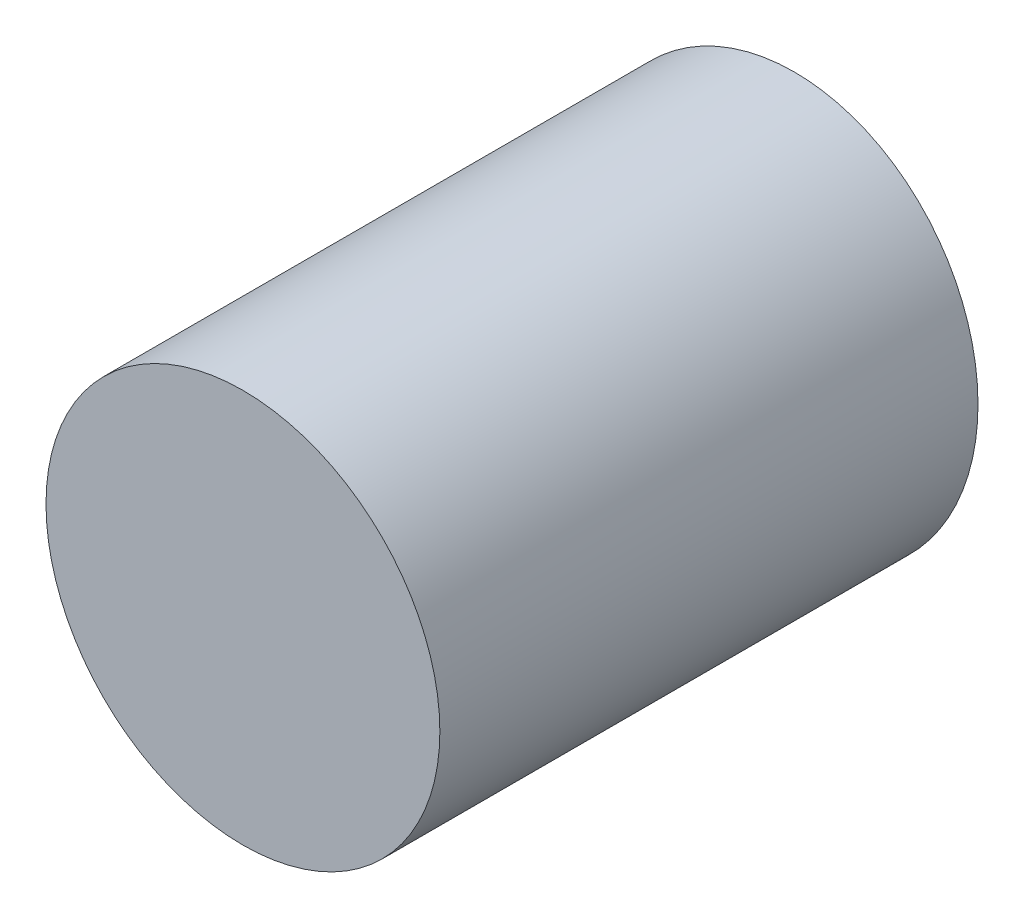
from build123d import *

# Parameters (mm, degrees)
SKETCH1_R               = 3.175
EXTRUDE1_DEPTH          = 8.89
CUT_EXTRUDE1_DEPTH      = 6.35
CUT_EXTRUDE1_DEPTH_BACK = 6.35
SKETCH3_R               = 1.143
CUT_EXTRUDE2_DEPTH      = 2.54


with BuildPart() as part:
    # Sketch1 → Extrude1 (new body)
    with BuildSketch(Plane.XY):
        Circle(SKETCH1_R)
    extrude(amount=EXTRUDE1_DEPTH)

    # Sketch2 → Cut-Extrude1 (cut, two sides: drawn at the far end of the back side and taken through both)
    with BuildSketch(Plane(origin=(0, 0, 0), x_dir=(0, 0, -1), z_dir=(1, 0, 0)).offset(-CUT_EXTRUDE1_DEPTH_BACK)):
        Polygon((0, 3.175), (-0.457512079, -3.36772755), (0, -3.36772755), align=None)
    extrude(amount=CUT_EXTRUDE1_DEPTH + CUT_EXTRUDE1_DEPTH_BACK, mode=Mode.SUBTRACT)

    # Sketch3 → Cut-Extrude2 (cut)
    with BuildSketch(Plane(origin=(0, 0.015449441, 0.220937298), x_dir=(-1, 0, 0), z_dir=(0, -0.06975647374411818, -0.9975640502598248))):
        with Locations(Location((0, 0, 0), (0, 0, 90))):
            Circle(SKETCH3_R)
    extrude(amount=-CUT_EXTRUDE2_DEPTH, mode=Mode.SUBTRACT)


solid = part.part
